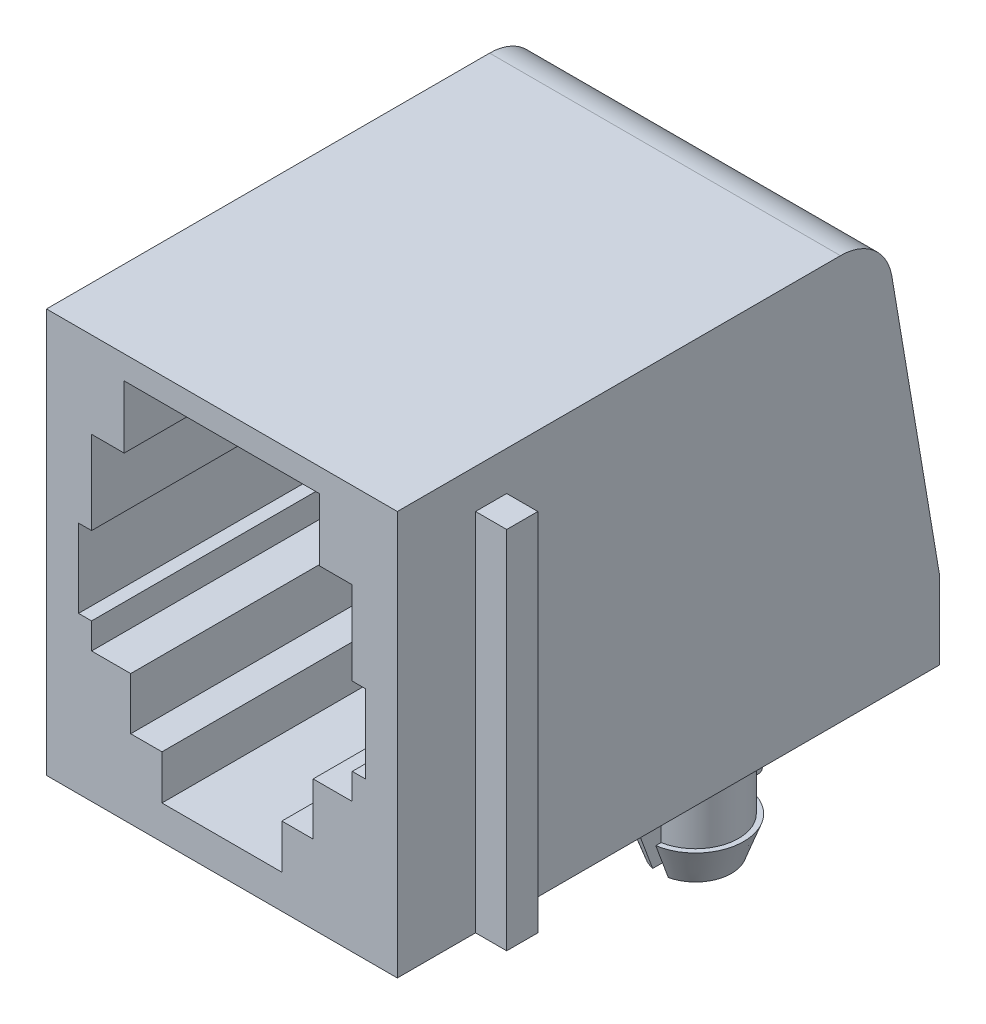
from build123d import *

# Parameters (mm, degrees)
SKETCH_1_R                  = 0.4
EXTRUDE_1_DEPTH             = 3.3
SKETCH_2_W                  = 13.46
SKETCH_2_H                  = 20.8
EXTRUDE_2_DEPTH             = 15.5
CUT_EXTRUDE_1_DEPTH         = 11.3
CUT_EXTRUDE_3_DEPTH         = 29.334475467
SKETCH_8_W                  = 10
SKETCH_8_H                  = 10
CUT_EXTRUDE_4_DEPTH         = 5
EXTRUDE_3_DEPTH             = 0.3
PATTERN_LINEAR_1_COUNT      = 6
PATTERN_LINEAR_1_PITCH      = 1.27
PATTERN_LINEAR_1_COUNT_DIR2 = 2
PATTERN_LINEAR_1_PITCH_DIR2 = 2.54
PATTERN_LINEAR_3_COUNT      = 6
PATTERN_LINEAR_3_PITCH      = 1.27
SKETCH_6_W                  = 3.7
SKETCH_6_H                  = 3.3
CUT_EXTRUDE_2_DEPTH         = 0.3
PATTERN_LINEAR_4_COUNT      = 2
PATTERN_LINEAR_4_PITCH      = 9.98
SKETCH_9_W                  = 1.195
SKETCH_9_H                  = 1.195
EXTRUDE_4_DEPTH             = 14


with BuildPart() as part:
    # Sketch 1 → Extrude 1 (new body)
    with BuildSketch(Plane(origin=(0, 0, 0), x_dir=(1, 0, 0), z_dir=(0, 1, 0))):
        with Locations(Location((0, 0, 0), (0, 0, 270))):
            Circle(SKETCH_1_R)
    extrude_1 = extrude(amount=-EXTRUDE_1_DEPTH)

    # Sketch 2 → Extrude 2 (add)
    with BuildSketch(Plane(origin=(0, 0, 0), x_dir=(1, 0, 0), z_dir=(0, 1, 0))):
        with Locations((3.175, -9.13)):
            Rectangle(SKETCH_2_W, SKETCH_2_H)
    extrude(amount=EXTRUDE_2_DEPTH)

    # Sketch 3 → Cut-Extrude 1 (cut)
    with BuildSketch(Plane(origin=(0, 0, 19.53), x_dir=(-1, 0, 0), z_dir=(0, 0, -1))):
        Polygon((-0.875, 1.3), (-5.475, 1.3), (-5.475, 3), (-6.675, 3), (-6.675, 5), (-8.175, 5), (-8.175, 6), (-8.675, 6), (-8.675, 9), (-8.175, 9), (-8.175, 12.2), (-6.925, 12.2), (-6.925, 14.6), (0.575, 14.6), (0.575, 12.2), (1.825, 12.2), (1.825, 9), (2.325, 9), (2.325, 6), (1.825, 6), (1.825, 5), (0.325, 5), (0.325, 3), (-0.875, 3), align=None)
    extrude(amount=CUT_EXTRUDE_1_DEPTH, mode=Mode.SUBTRACT)

    # Sketch 7 → Cut-Extrude 3 (cut, through all)
    with BuildSketch(Plane(origin=(9.905, 0, 0), x_dir=(0, 0, -1), z_dir=(1, 0, 0))):
        with BuildLine():
            Line((1.27, 3), (-0.557877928, 13.832767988))
            ThreePointArc((-0.557877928, 13.832767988), (-1.238786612, 15.027340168), (-2.53, 15.5))
            Line((-2.53, 15.5), (1.27, 15.5))
            Line((1.27, 15.5), (1.27, 3))
        make_face()
    extrude(amount=-CUT_EXTRUDE_3_DEPTH, mode=Mode.SUBTRACT)

    # Sketch 8 → Cut-Extrude 4 (cut)
    with BuildSketch(Plane(origin=(0, 0, -1.27), x_dir=(-1, 0, 0), z_dir=(0, 0, -1))):
        with Locations((-3.175, 8)):
            Rectangle(SKETCH_8_W, SKETCH_8_H)
    extrude(amount=-CUT_EXTRUDE_4_DEPTH, mode=Mode.SUBTRACT)

    # Sketch 4 → Extrude 3 (add, symmetric)
    with BuildSketch(Plane(origin=(0, 0, 0), x_dir=(0, 0, -1), z_dir=(1, 0, 0))):
        with BuildLine():
            Line((0.3, 2), (0.3, 5))
            ThreePointArc((0.3, 5), (0.28149858, 5.442462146), (0.22612349, 5.881835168))
            Line((0.22612349, 5.881835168), (-1.100048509, 13.741284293))
            ThreePointArc((-1.100048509, 13.741284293), (-1.59376358, 14.607447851), (-2.53, 14.950165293))
            Line((-2.53, 14.950165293), (-16.53, 14.950165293))
            ThreePointArc((-16.53, 14.950165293), (-17.423351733, 14.159356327), (-16.746768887, 13.176660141))
            Line((-16.746768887, 13.176660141), (-6.802256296, 10.708831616))
            ThreePointArc((-6.802256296, 10.708831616), (-6.438831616, 10.927743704), (-6.657743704, 11.291168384))
            Line((-6.657743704, 11.291168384), (-16.602256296, 13.758996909))
            ThreePointArc((-16.602256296, 13.758996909), (-16.827783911, 14.086562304), (-16.53, 14.350165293))
            Line((-16.53, 14.350165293), (-2.53, 14.350165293))
            ThreePointArc((-2.53, 14.350165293), (-1.981127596, 14.1492458), (-1.691685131, 13.641453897))
            Line((-1.691685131, 13.641453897), (-0.365513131, 5.782004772))
            ThreePointArc((-0.365513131, 5.782004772), (-0.31640692, 5.392372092), (-0.3, 5))
            Line((-0.3, 5), (-0.3, 2))
            ThreePointArc((-0.3, 2), (0, 1.7), (0.3, 2))
        make_face()
    extrude_3 = extrude(amount=EXTRUDE_3_DEPTH, both=True)

    # Pattern Linear 1: Extrude 1 6 × 2, 6 skipped
    with Locations(*[(i * PATTERN_LINEAR_1_PITCH, 0, j * PATTERN_LINEAR_1_PITCH_DIR2) for i in range(PATTERN_LINEAR_1_COUNT) for j in range(PATTERN_LINEAR_1_COUNT_DIR2) if (i, j) not in ((0, 0), (0, 1), (1, 0), (2, 1), (3, 0), (4, 1), (5, 0))]):
        add(extrude_1)

    # Pattern Linear 3: Extrude 3 ×6
    with Locations(*[(i * PATTERN_LINEAR_3_PITCH, 0, 0) for i in range(1, PATTERN_LINEAR_3_COUNT)]):
        add(extrude_3)

    # Sketch 5 → Revolve 1 (revolve)
    with BuildSketch(Plane(origin=(-1.815, 0, 0), x_dir=(0, 0, -1), z_dir=(1, 0, 0)), mode=Mode.PRIVATE) as revolve_1_sk:
        Polygon((-6.35, -3.3), (-4.973161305, -3.3), (-4.5, -2), (-4.7, -2), (-4.7, 0), (-6.35, 0), align=None)
    revolve_1 = revolve(revolve_1_sk.sketch.rotate(Axis((-1.815, 0, 6.35), (0, -1, 0)), 180), axis=Axis((-1.815, 0, 6.35), (0, -1, 0)))

    # Sketch 6 → Cut-Extrude 2 (cut, symmetric)
    with BuildSketch(Plane(origin=(-1.815, 0, 0), x_dir=(0, 0, -1), z_dir=(1, 0, 0))):
        with Locations((-6.35, -1.65)):
            Rectangle(SKETCH_6_W, SKETCH_6_H)
    cut_extrude_2 = extrude(amount=CUT_EXTRUDE_2_DEPTH, both=True, mode=Mode.SUBTRACT)

    # Pattern Linear 4: Revolve 1, Cut-Extrude 2 ×2
    with Locations(*[(i * PATTERN_LINEAR_4_PITCH, 0, 0) for i in range(1, PATTERN_LINEAR_4_COUNT)]):
        add(revolve_1)
        add(cut_extrude_2, mode=Mode.SUBTRACT)

    # Sketch 9 → Extrude 4 (add)
    with BuildSketch(Plane(origin=(0, 0, 0), x_dir=(1, 0, 0), z_dir=(0, 1, 0))):
        with Locations((-4.1525, -15.9325)):
            Rectangle(SKETCH_9_W, SKETCH_9_H)
        with Locations((10.5025, -15.9325)):
            Rectangle(SKETCH_9_W, SKETCH_9_H)
    extrude(amount=EXTRUDE_4_DEPTH)


solid = part.part
